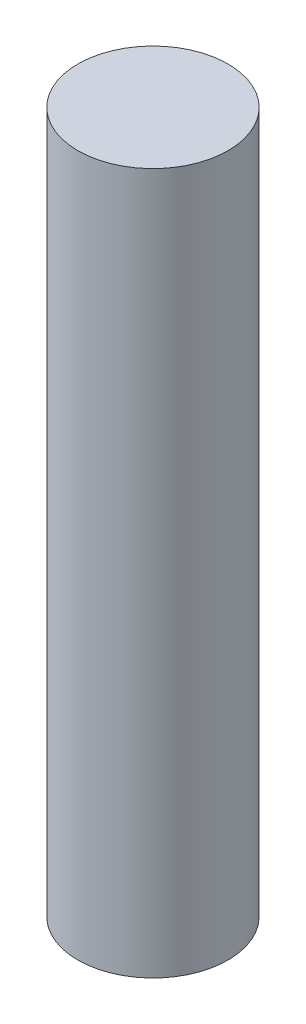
from build123d import *

# Parameters (mm, degrees)
SKETCH1_W = 3
SKETCH1_H = 28


with BuildPart() as part:
    # Sketch1 → Revolve1 (revolve)
    with BuildSketch(Plane(origin=(0, 0, 0), x_dir=(0, 0, -1), z_dir=(1, 0, 0)), mode=Mode.PRIVATE) as revolve1_sk:
        with Locations((1.5, -14)):
            Rectangle(SKETCH1_W, SKETCH1_H)
    revolve(revolve1_sk.sketch.rotate(Axis((0, 42.86395739, 0), (0, -1, 0)), 180), axis=Axis((0, 42.86395739, 0), (0, -1, 0)))


solid = part.part
